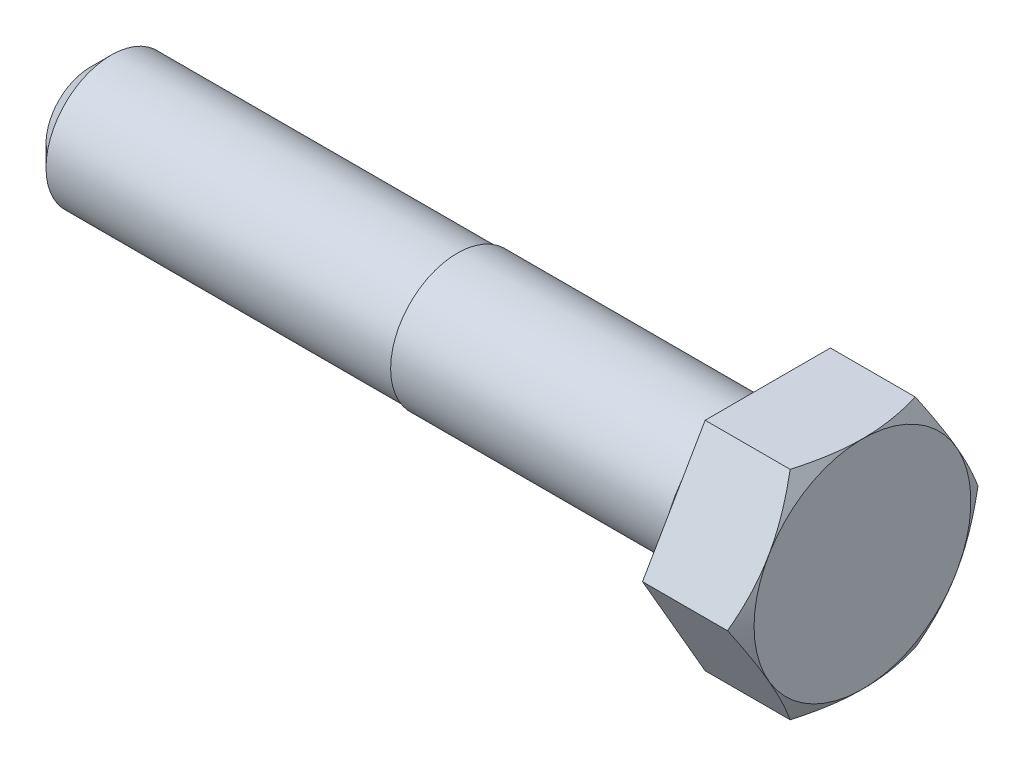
ISO-10303-21;
HEADER;
FILE_DESCRIPTION(('STEP AP214'),'2;1');
FILE_NAME('part.step','',(''),(''),'','','');
FILE_SCHEMA(('AUTOMOTIVE_DESIGN { 1 0 10303 214 1 1 1 1 }'));
ENDSEC;
DATA;
#1=APPLICATION_CONTEXT('core data for automotive mechanical design processes');
#2=APPLICATION_PROTOCOL_DEFINITION('international standard','automotive_design',2000,#1);
#3=PRODUCT_CONTEXT('',#1,'mechanical');
#4=PRODUCT('Part','Part','',(#3));
#5=PRODUCT_RELATED_PRODUCT_CATEGORY('part','',(#4));
#6=PRODUCT_DEFINITION_FORMATION('','',#4);
#7=PRODUCT_DEFINITION_CONTEXT('part definition',#1,'design');
#8=PRODUCT_DEFINITION('design','',#6,#7);
#9=PRODUCT_DEFINITION_SHAPE('','',#8);
#10=(LENGTH_UNIT() NAMED_UNIT(*) SI_UNIT(.MILLI.,.METRE.));
#11=(NAMED_UNIT(*) PLANE_ANGLE_UNIT() SI_UNIT($,.RADIAN.));
#12=(NAMED_UNIT(*) SI_UNIT($,.STERADIAN.) SOLID_ANGLE_UNIT());
#13=UNCERTAINTY_MEASURE_WITH_UNIT(LENGTH_MEASURE(1.E-05),#10,'distance_accuracy_value','');
#14=(GEOMETRIC_REPRESENTATION_CONTEXT(3) GLOBAL_UNCERTAINTY_ASSIGNED_CONTEXT((#13)) GLOBAL_UNIT_ASSIGNED_CONTEXT((#10,
#11,#12)) REPRESENTATION_CONTEXT('',''));
#15=CARTESIAN_POINT('',(0.,0.,0.));
#16=DIRECTION('',(0.,0.,1.));
#17=DIRECTION('',(1.,0.,0.));
#18=AXIS2_PLACEMENT_3D('',#15,#16,#17);
#19=CARTESIAN_POINT('',(6.275,0.,0.));
#20=DIRECTION('',(1.,0.,0.));
#21=DIRECTION('',(0.,0.,-1.));
#22=AXIS2_PLACEMENT_3D('',#19,#20,#21);
#23=PLANE('',#22);
#24=CARTESIAN_POINT('',(6.27500000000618,0.,0.));
#25=DIRECTION('',(-1.,0.,0.));
#26=DIRECTION('',(0.,0.,1.));
#27=AXIS2_PLACEMENT_3D('',#24,#25,#26);
#28=CIRCLE('',#27,6.49675162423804);
#29=CARTESIAN_POINT('',(6.27500000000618,0.,6.49675162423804));
#30=VERTEX_POINT('',#29);
#31=EDGE_CURVE('E85',#30,#30,#28,.T.);
#32=ORIENTED_EDGE('',*,*,#31,.F.);
#33=EDGE_LOOP('',(#32));
#34=FACE_BOUND('',#33,.T.);
#35=ADVANCED_FACE('F16',(#34),#23,.T.);
#36=CARTESIAN_POINT('',(5.68905357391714,0.,0.));
#37=DIRECTION('',(-1.,0.,0.));
#38=DIRECTION('',(0.,0.,1.));
#39=AXIS2_PLACEMENT_3D('',#36,#37,#38);
#40=CONICAL_SURFACE('',#39,7.51164060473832,1.04719755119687);
#41=ORIENTED_EDGE('',*,*,#31,.T.);
#42=EDGE_LOOP('',(#41));
#43=FACE_BOUND('',#42,.T.);
#44=CARTESIAN_POINT('',(5.69256796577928,1.20528046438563E-11,-7.50555349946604));
#45=CARTESIAN_POINT('',(5.7778959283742,-0.255970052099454,-7.35776912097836));
#46=CARTESIAN_POINT('',(5.85630952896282,-0.513867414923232,-7.2088720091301));
#47=CARTESIAN_POINT('',(5.99585171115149,-1.03368204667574,-6.90875689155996));
#48=CARTESIAN_POINT('',(6.05694401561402,-1.29560655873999,-6.75753470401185));
#49=CARTESIAN_POINT('',(6.15687215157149,-1.81667951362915,-6.45669309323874));
#50=CARTESIAN_POINT('',(6.1961752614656,-2.07575899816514,-6.30711348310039));
#51=CARTESIAN_POINT('',(6.25170948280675,-2.59557331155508,-6.00699854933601));
#52=CARTESIAN_POINT('',(6.26796354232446,-2.85630623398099,-5.85646432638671));
#53=CARTESIAN_POINT('',(6.27430814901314,-3.25837855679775,-5.62432776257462));
#54=CARTESIAN_POINT('',(6.27297742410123,-3.39965097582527,-5.54276409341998));
#55=CARTESIAN_POINT('',(6.26326074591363,-3.68202291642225,-5.37973657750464));
#56=CARTESIAN_POINT('',(6.25487464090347,-3.82312243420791,-5.29827273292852));
#57=CARTESIAN_POINT('',(6.23122631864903,-4.10503825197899,-5.13550855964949));
#58=CARTESIAN_POINT('',(6.21595662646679,-4.24585407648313,-5.05420850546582));
#59=CARTESIAN_POINT('',(6.17889071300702,-4.52684665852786,-4.89197736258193));
#60=CARTESIAN_POINT('',(6.15709394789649,-4.66702336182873,-4.81104630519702));
#61=CARTESIAN_POINT('',(6.08135698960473,-5.09317727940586,-4.56500622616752));
#62=CARTESIAN_POINT('',(6.01768275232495,-5.37785705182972,-4.40064628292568));
#63=CARTESIAN_POINT('',(5.86954600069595,-5.94247463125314,-4.07466417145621));
#64=CARTESIAN_POINT('',(5.78513220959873,-6.2224219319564,-3.91303652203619));
#65=CARTESIAN_POINT('',(5.69256796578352,-6.50000000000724,-3.75277674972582));
#66=B_SPLINE_CURVE_WITH_KNOTS('',3,(#44,#45,#46,#47,#48,#49,#50,#51,#52,#53,#54,#55,#56,#57,#58,
#59,#60,#61,#62,#63,#64,#65),.UNSPECIFIED.,.F.,.F.,(4,2,2,2,2,2,2,2,2,2,4),(0.,
0.923168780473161,1.84825696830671,2.75265222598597,3.65614641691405,4.14541079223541,
4.63468569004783,5.12449317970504,5.61434149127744,6.61801291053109,7.61934858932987),.UNSPECIFIED.);
#67=CARTESIAN_POINT('',(5.69256796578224,5.21451335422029E-12,-7.50555349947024));
#68=VERTEX_POINT('',#67);
#69=CARTESIAN_POINT('',(5.69256796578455,-6.5,-3.75277674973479));
#70=VERTEX_POINT('',#69);
#71=EDGE_CURVE('E126',#68,#70,#66,.T.);
#72=ORIENTED_EDGE('',*,*,#71,.F.);
#73=CARTESIAN_POINT('',(5.69256796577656,6.5000000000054,-3.75277674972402));
#74=CARTESIAN_POINT('',(5.74018403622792,6.3571242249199,-3.83526611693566));
#75=CARTESIAN_POINT('',(5.78563893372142,6.2137157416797,-3.91806304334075));
#76=CARTESIAN_POINT('',(5.87163117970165,5.92573416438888,-4.08432928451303));
#77=CARTESIAN_POINT('',(5.91216640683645,5.78116059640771,-4.16779887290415));
#78=CARTESIAN_POINT('',(6.02559686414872,5.34512525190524,-4.4195439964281));
#79=CARTESIAN_POINT('',(6.09011380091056,5.05194235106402,-4.58881322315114));
#80=CARTESIAN_POINT('',(6.16576570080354,4.61319950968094,-4.84212152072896));
#81=CARTESIAN_POINT('',(6.1873163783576,4.46895035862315,-4.92540380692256));
#82=CARTESIAN_POINT('',(6.22345285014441,4.17980036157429,-5.09234463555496));
#83=CARTESIAN_POINT('',(6.23803925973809,4.0348995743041,-5.17600314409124));
#84=CARTESIAN_POINT('',(6.25987545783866,3.74484642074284,-5.34346541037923));
#85=CARTESIAN_POINT('',(6.26713357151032,3.59969452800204,-5.42726889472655));
#86=CARTESIAN_POINT('',(6.27416533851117,3.30926477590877,-5.59494859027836));
#87=CARTESIAN_POINT('',(6.27393922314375,3.16398692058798,-5.67882479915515));
#88=CARTESIAN_POINT('',(6.26303299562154,2.76599791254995,-5.90860386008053));
#89=CARTESIAN_POINT('',(6.24473352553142,2.51341711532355,-6.0544314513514));
#90=CARTESIAN_POINT('',(6.18671200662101,2.00993309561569,-6.34511808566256));
#91=CARTESIAN_POINT('',(6.14697013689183,1.75903164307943,-6.48997610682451));
#92=CARTESIAN_POINT('',(6.04762945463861,1.25453482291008,-6.78124748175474));
#93=CARTESIAN_POINT('',(5.98760985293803,1.00100309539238,-6.92762409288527));
#94=CARTESIAN_POINT('',(5.85139051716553,0.497719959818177,-7.21819474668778));
#95=CARTESIAN_POINT('',(5.77522276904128,0.247962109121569,-7.36239250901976));
#96=CARTESIAN_POINT('',(5.69256796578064,-5.23683170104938E-12,-7.50555349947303));
#97=B_SPLINE_CURVE_WITH_KNOTS('',3,(#73,#74,#75,#76,#77,#78,#79,#80,#81,#82,#83,#84,#85,#86,#87,
#88,#89,#90,#91,#92,#93,#94,#95,#96),.UNSPECIFIED.,.F.,.F.,(4,2,2,2,2,2,2,2,2,2,2,4),(0.,
0.515097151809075,1.0304156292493,2.06319349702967,2.56693469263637,3.07063136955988,
3.57375518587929,4.0768634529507,4.95263085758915,5.82920919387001,6.72522583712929,
7.6194839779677),.UNSPECIFIED.);
#98=CARTESIAN_POINT('',(5.69256796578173,6.50000000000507,-3.75277674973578));
#99=VERTEX_POINT('',#98);
#100=EDGE_CURVE('E81',#99,#68,#97,.T.);
#101=ORIENTED_EDGE('',*,*,#100,.F.);
#102=CARTESIAN_POINT('',(5.69256796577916,6.49999999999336,3.75277674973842));
#103=CARTESIAN_POINT('',(5.74018403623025,6.49999999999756,3.5877980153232));
#104=CARTESIAN_POINT('',(5.78563893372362,6.49999999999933,3.42220416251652));
#105=CARTESIAN_POINT('',(5.87163117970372,6.50000000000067,3.0896716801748));
#106=CARTESIAN_POINT('',(5.91216640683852,6.50000000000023,2.92273250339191));
#107=CARTESIAN_POINT('',(6.02559686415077,6.49999999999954,2.41924225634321));
#108=CARTESIAN_POINT('',(6.09011380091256,6.49999999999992,2.08070380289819));
#109=CARTESIAN_POINT('',(6.1657657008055,6.50000000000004,1.57408720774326));
#110=CARTESIAN_POINT('',(6.18731637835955,6.50000000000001,1.40752263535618));
#111=CARTESIAN_POINT('',(6.22345285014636,6.49999999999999,1.07364097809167));
#112=CARTESIAN_POINT('',(6.23803925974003,6.5,0.906323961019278));
#113=CARTESIAN_POINT('',(6.25987545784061,6.5,0.571399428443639));
#114=CARTESIAN_POINT('',(6.26713357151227,6.5,0.403792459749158));
#115=CARTESIAN_POINT('',(6.27416533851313,6.5,0.0684330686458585));
#116=CARTESIAN_POINT('',(6.27393922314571,6.5,-0.099319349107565));
#117=CARTESIAN_POINT('',(6.26303299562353,6.5,-0.558877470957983));
#118=CARTESIAN_POINT('',(6.24473352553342,6.5,-0.850532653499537));
#119=CARTESIAN_POINT('',(6.18671200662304,6.5,-1.4319059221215));
#120=CARTESIAN_POINT('',(6.14697013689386,6.5,-1.72162196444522));
#121=CARTESIAN_POINT('',(6.04762945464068,6.5,-2.30416471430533));
#122=CARTESIAN_POINT('',(5.98760985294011,6.5,-2.5969179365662));
#123=CARTESIAN_POINT('',(5.85139051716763,6.5,-3.17805924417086));
#124=CARTESIAN_POINT('',(5.77522276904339,6.5,-3.46645476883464));
#125=CARTESIAN_POINT('',(5.69256796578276,6.5,-3.75277674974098));
#126=B_SPLINE_CURVE_WITH_KNOTS('',3,(#102,#103,#104,#105,#106,#107,#108,#109,#110,#111,#112,
#113,#114,#115,#116,#117,#118,#119,#120,#121,#122,#123,#124,#125),.UNSPECIFIED.,.F.,.F.,(4,2,2,
2,2,2,2,2,2,2,2,4),(0.,0.51509715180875,1.03041562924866,2.0631934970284,2.56693469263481,
3.07063136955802,3.57375518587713,4.07686345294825,4.95263085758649,5.82920919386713,
6.7252258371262,7.6194839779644),.UNSPECIFIED.);
#127=CARTESIAN_POINT('',(5.69256796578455,6.5,3.75277674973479));
#128=VERTEX_POINT('',#127);
#129=EDGE_CURVE('E74',#128,#99,#126,.T.);
#130=ORIENTED_EDGE('',*,*,#129,.F.);
#131=CARTESIAN_POINT('',(5.69256796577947,-1.1674643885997E-11,7.50555349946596));
#132=CARTESIAN_POINT('',(5.77789592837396,0.255970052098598,7.35776912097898));
#133=CARTESIAN_POINT('',(5.85630952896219,0.513867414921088,7.20887200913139));
#134=CARTESIAN_POINT('',(5.99585171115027,1.03368204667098,6.90875689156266));
#135=CARTESIAN_POINT('',(6.05694401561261,1.29560655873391,6.75753470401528));
#136=CARTESIAN_POINT('',(6.15687215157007,1.81667951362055,6.45669309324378));
#137=CARTESIAN_POINT('',(6.19617526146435,2.07575899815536,6.30711348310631));
#138=CARTESIAN_POINT('',(6.25170948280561,2.59557331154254,6.00699854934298));
#139=CARTESIAN_POINT('',(6.26796354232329,2.8563062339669,5.85646432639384));
#140=CARTESIAN_POINT('',(6.27430814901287,3.25837855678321,5.62432776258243));
#141=CARTESIAN_POINT('',(6.2729774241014,3.39965097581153,5.54276409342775));
#142=CARTESIAN_POINT('',(6.26326074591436,3.68202291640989,5.37973657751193));
#143=CARTESIAN_POINT('',(6.2548746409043,3.82312243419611,5.29827273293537));
#144=CARTESIAN_POINT('',(6.23122631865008,4.1050382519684,5.13550855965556));
#145=CARTESIAN_POINT('',(6.21595662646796,4.24585407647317,5.05420850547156));
#146=CARTESIAN_POINT('',(6.17889071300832,4.52684665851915,4.89197736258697));
#147=CARTESIAN_POINT('',(6.15709394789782,4.66702336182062,4.8110463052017));
#148=CARTESIAN_POINT('',(6.08135698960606,5.09317727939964,4.5650062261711));
#149=CARTESIAN_POINT('',(6.01768275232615,5.37785705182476,4.40064628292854));
#150=CARTESIAN_POINT('',(5.8695460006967,5.94247463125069,4.07466417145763));
#151=CARTESIAN_POINT('',(5.78513220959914,6.22242193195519,3.9130365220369));
#152=CARTESIAN_POINT('',(5.69256796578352,6.50000000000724,3.75277674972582));
#153=B_SPLINE_CURVE_WITH_KNOTS('',3,(#131,#132,#133,#134,#135,#136,#137,#138,#139,#140,#141,
#142,#143,#144,#145,#146,#147,#148,#149,#150,#151,#152),.UNSPECIFIED.,.F.,.F.,(4,2,2,2,2,2,2,2,
2,2,4),(0.,0.923168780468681,1.84825696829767,2.75265222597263,3.65614641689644,
4.14541079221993,4.63468569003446,5.12449317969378,5.61434149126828,6.61801291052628,
7.61934858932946),.UNSPECIFIED.);
#154=CARTESIAN_POINT('',(5.6925679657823,-5.04355734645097E-12,7.50555349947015));
#155=VERTEX_POINT('',#154);
#156=EDGE_CURVE('E78',#155,#128,#153,.T.);
#157=ORIENTED_EDGE('',*,*,#156,.F.);
#158=CARTESIAN_POINT('',(5.69256796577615,-6.50000000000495,3.75277674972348));
#159=CARTESIAN_POINT('',(5.74018403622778,-6.35712422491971,3.83526611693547));
#160=CARTESIAN_POINT('',(5.78563893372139,-6.21371574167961,3.91806304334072));
#161=CARTESIAN_POINT('',(5.87163117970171,-5.92573416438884,4.08432928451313));
#162=CARTESIAN_POINT('',(5.91216640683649,-5.78116059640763,4.16779887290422));
#163=CARTESIAN_POINT('',(6.02559686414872,-5.34512525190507,4.41954399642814));
#164=CARTESIAN_POINT('',(6.09011380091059,-5.05194235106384,4.58881322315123));
#165=CARTESIAN_POINT('',(6.16576570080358,-4.61319950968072,4.84212152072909));
#166=CARTESIAN_POINT('',(6.18731637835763,-4.46895035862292,4.92540380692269));
#167=CARTESIAN_POINT('',(6.22345285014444,-4.17980036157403,5.0923446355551));
#168=CARTESIAN_POINT('',(6.23803925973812,-4.03489957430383,5.17600314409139));
#169=CARTESIAN_POINT('',(6.25987545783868,-3.74484642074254,5.34346541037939));
#170=CARTESIAN_POINT('',(6.26713357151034,-3.59969452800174,5.42726889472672));
#171=CARTESIAN_POINT('',(6.27416533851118,-3.30926477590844,5.59494859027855));
#172=CARTESIAN_POINT('',(6.27393922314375,-3.16398692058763,5.67882479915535));
#173=CARTESIAN_POINT('',(6.26303299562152,-2.7659979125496,5.90860386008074));
#174=CARTESIAN_POINT('',(6.24473352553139,-2.5134171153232,6.0544314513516));
#175=CARTESIAN_POINT('',(6.18671200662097,-2.00993309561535,6.34511808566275));
#176=CARTESIAN_POINT('',(6.14697013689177,-1.7590316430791,6.4899761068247));
#177=CARTESIAN_POINT('',(6.04762945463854,-1.25453482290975,6.78124748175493));
#178=CARTESIAN_POINT('',(5.98760985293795,-1.00100309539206,6.92762409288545));
#179=CARTESIAN_POINT('',(5.85139051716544,-0.497719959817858,7.21819474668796));
#180=CARTESIAN_POINT('',(5.77522276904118,-0.247962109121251,7.36239250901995));
#181=CARTESIAN_POINT('',(5.69256796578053,5.55470790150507E-12,7.50555349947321));
#182=B_SPLINE_CURVE_WITH_KNOTS('',3,(#158,#159,#160,#161,#162,#163,#164,#165,#166,#167,#168,
#169,#170,#171,#172,#173,#174,#175,#176,#177,#178,#179,#180,#181),.UNSPECIFIED.,.F.,.F.,(4,2,2,
2,2,2,2,2,2,2,2,4),(0.,0.515097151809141,1.03041562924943,2.0631934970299,2.56693469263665,
3.0706313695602,3.57375518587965,4.07686345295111,4.95263085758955,5.82920919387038,
6.72522583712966,7.61948397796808),.UNSPECIFIED.);
#183=CARTESIAN_POINT('',(5.69256796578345,-6.50000000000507,3.75277674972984));
#184=VERTEX_POINT('',#183);
#185=EDGE_CURVE('E99',#184,#155,#182,.T.);
#186=ORIENTED_EDGE('',*,*,#185,.F.);
#187=CARTESIAN_POINT('',(5.69256796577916,-6.49999999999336,-3.75277674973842));
#188=CARTESIAN_POINT('',(5.74018403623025,-6.49999999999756,-3.5877980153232));
#189=CARTESIAN_POINT('',(5.78563893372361,-6.49999999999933,-3.42220416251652));
#190=CARTESIAN_POINT('',(5.87163117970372,-6.50000000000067,-3.0896716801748));
#191=CARTESIAN_POINT('',(5.91216640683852,-6.50000000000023,-2.92273250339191));
#192=CARTESIAN_POINT('',(6.02559686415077,-6.49999999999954,-2.41924225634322));
#193=CARTESIAN_POINT('',(6.09011380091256,-6.49999999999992,-2.08070380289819));
#194=CARTESIAN_POINT('',(6.1657657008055,-6.50000000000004,-1.57408720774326));
#195=CARTESIAN_POINT('',(6.18731637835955,-6.50000000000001,-1.40752263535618));
#196=CARTESIAN_POINT('',(6.22345285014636,-6.49999999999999,-1.07364097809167));
#197=CARTESIAN_POINT('',(6.23803925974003,-6.5,-0.90632396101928));
#198=CARTESIAN_POINT('',(6.25987545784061,-6.5,-0.57139942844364));
#199=CARTESIAN_POINT('',(6.26713357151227,-6.5,-0.403792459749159));
#200=CARTESIAN_POINT('',(6.27416533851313,-6.5,-0.0684330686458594));
#201=CARTESIAN_POINT('',(6.27393922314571,-6.5,0.0993193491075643));
#202=CARTESIAN_POINT('',(6.26303299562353,-6.5,0.558877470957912));
#203=CARTESIAN_POINT('',(6.24473352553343,-6.5,0.850532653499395));
#204=CARTESIAN_POINT('',(6.18671200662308,-6.5,1.43190592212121));
#205=CARTESIAN_POINT('',(6.14697013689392,-6.5,1.72162196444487));
#206=CARTESIAN_POINT('',(6.04762945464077,-6.5,2.30416471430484));
#207=CARTESIAN_POINT('',(5.98760985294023,-6.5,2.59691793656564));
#208=CARTESIAN_POINT('',(5.85139051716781,-6.5,3.17805924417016));
#209=CARTESIAN_POINT('',(5.7752227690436,-6.5,3.46645476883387));
#210=CARTESIAN_POINT('',(5.69256796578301,-6.5,3.75277674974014));
#211=B_SPLINE_CURVE_WITH_KNOTS('',3,(#187,#188,#189,#190,#191,#192,#193,#194,#195,#196,#197,
#198,#199,#200,#201,#202,#203,#204,#205,#206,#207,#208,#209,#210),.UNSPECIFIED.,.F.,.F.,(4,2,2,
2,2,2,2,2,2,2,2,4),(0.,0.51509715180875,1.03041562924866,2.0631934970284,2.56693469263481,
3.07063136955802,3.57375518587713,4.07686345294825,4.95263085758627,5.82920919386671,
6.72522583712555,7.61948397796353),.UNSPECIFIED.);
#212=EDGE_CURVE('E133',#70,#184,#211,.T.);
#213=ORIENTED_EDGE('',*,*,#212,.F.);
#214=EDGE_LOOP('',(#72,#101,#130,#157,#186,#213));
#215=FACE_BOUND('',#214,.T.);
#216=ADVANCED_FACE('F76',(#43,#215),#40,.T.);
#217=CARTESIAN_POINT('',(0.6,6.5,-3.75277674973));
#218=DIRECTION('',(0.,1.,0.));
#219=DIRECTION('',(0.,0.,1.));
#220=AXIS2_PLACEMENT_3D('',#217,#218,#219);
#221=PLANE('',#220);
#222=DIRECTION('',(1.,0.,0.));
#223=VECTOR('',#222,1.);
#224=CARTESIAN_POINT('',(0.6,6.5,3.75277674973));
#225=LINE('',#224,#223);
#226=CARTESIAN_POINT('',(0.6,6.5,3.75277674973));
#227=VERTEX_POINT('',#226);
#228=EDGE_CURVE('E84',#128,#227,#225,.F.);
#229=ORIENTED_EDGE('',*,*,#228,.F.);
#230=ORIENTED_EDGE('',*,*,#129,.T.);
#231=DIRECTION('',(1.,0.,0.));
#232=VECTOR('',#231,1.);
#233=CARTESIAN_POINT('',(0.6,6.5000000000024,-3.75277674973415));
#234=LINE('',#233,#232);
#235=CARTESIAN_POINT('',(0.6,6.5000000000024,-3.75277674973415));
#236=VERTEX_POINT('',#235);
#237=EDGE_CURVE('E143',#236,#99,#234,.T.);
#238=ORIENTED_EDGE('',*,*,#237,.F.);
#239=DIRECTION('',(0.,0.,-1.));
#240=VECTOR('',#239,1.);
#241=CARTESIAN_POINT('',(0.6,6.5,0.));
#242=LINE('',#241,#240);
#243=EDGE_CURVE('E90',#236,#227,#242,.F.);
#244=ORIENTED_EDGE('',*,*,#243,.T.);
#245=EDGE_LOOP('',(#229,#230,#238,#244));
#246=FACE_BOUND('',#245,.T.);
#247=ADVANCED_FACE('F88',(#246),#221,.T.);
#248=CARTESIAN_POINT('',(0.6,6.5,3.75277674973));
#249=DIRECTION('',(0.,0.50000000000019,0.866025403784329));
#250=DIRECTION('',(0.,-0.866025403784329,0.50000000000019));
#251=AXIS2_PLACEMENT_3D('',#248,#249,#250);
#252=PLANE('',#251);
#253=DIRECTION('',(1.,0.,0.));
#254=VECTOR('',#253,1.);
#255=CARTESIAN_POINT('',(0.6,0.,7.50555349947));
#256=LINE('',#255,#254);
#257=CARTESIAN_POINT('',(0.6,-8.96873440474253E-13,7.50555349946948));
#258=VERTEX_POINT('',#257);
#259=EDGE_CURVE('E96',#155,#258,#256,.F.);
#260=ORIENTED_EDGE('',*,*,#259,.F.);
#261=ORIENTED_EDGE('',*,*,#156,.T.);
#262=ORIENTED_EDGE('',*,*,#228,.T.);
#263=DIRECTION('',(0.,-0.86602540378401,0.500000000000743));
#264=VECTOR('',#263,1.);
#265=CARTESIAN_POINT('',(0.6,6.5,3.75277674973));
#266=LINE('',#265,#264);
#267=EDGE_CURVE('E265',#227,#258,#266,.T.);
#268=ORIENTED_EDGE('',*,*,#267,.T.);
#269=EDGE_LOOP('',(#260,#261,#262,#268));
#270=FACE_BOUND('',#269,.T.);
#271=ADVANCED_FACE('F94',(#270),#252,.T.);
#272=CARTESIAN_POINT('',(0.6,0.,7.50555349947));
#273=DIRECTION('',(0.,-0.50000000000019,0.866025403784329));
#274=DIRECTION('',(0.,-0.866025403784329,-0.50000000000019));
#275=AXIS2_PLACEMENT_3D('',#272,#273,#274);
#276=PLANE('',#275);
#277=DIRECTION('',(1.,0.,0.));
#278=VECTOR('',#277,1.);
#279=CARTESIAN_POINT('',(0.6,-6.5,3.75277674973));
#280=LINE('',#279,#278);
#281=CARTESIAN_POINT('',(0.6,-6.5,3.75277674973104));
#282=VERTEX_POINT('',#281);
#283=EDGE_CURVE('E249',#184,#282,#280,.F.);
#284=ORIENTED_EDGE('',*,*,#283,.F.);
#285=ORIENTED_EDGE('',*,*,#185,.T.);
#286=ORIENTED_EDGE('',*,*,#259,.T.);
#287=DIRECTION('',(0.,-0.86602540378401,-0.500000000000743));
#288=VECTOR('',#287,1.);
#289=CARTESIAN_POINT('',(0.6,0.,7.50555349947));
#290=LINE('',#289,#288);
#291=EDGE_CURVE('E273',#258,#282,#290,.T.);
#292=ORIENTED_EDGE('',*,*,#291,.T.);
#293=EDGE_LOOP('',(#284,#285,#286,#292));
#294=FACE_BOUND('',#293,.T.);
#295=ADVANCED_FACE('F160',(#294),#276,.T.);
#296=CARTESIAN_POINT('',(0.6,-6.5,3.75277674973));
#297=DIRECTION('',(0.,-1.,0.));
#298=DIRECTION('',(0.,0.,-1.));
#299=AXIS2_PLACEMENT_3D('',#296,#297,#298);
#300=PLANE('',#299);
#301=DIRECTION('',(1.,0.,0.));
#302=VECTOR('',#301,1.);
#303=CARTESIAN_POINT('',(0.6,-6.5,-3.75277674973));
#304=LINE('',#303,#302);
#305=CARTESIAN_POINT('',(0.6,-6.5,-3.75277674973));
#306=VERTEX_POINT('',#305);
#307=EDGE_CURVE('E244',#70,#306,#304,.F.);
#308=ORIENTED_EDGE('',*,*,#307,.F.);
#309=ORIENTED_EDGE('',*,*,#212,.T.);
#310=ORIENTED_EDGE('',*,*,#283,.T.);
#311=DIRECTION('',(0.,0.,-1.));
#312=VECTOR('',#311,1.);
#313=CARTESIAN_POINT('',(0.6,-6.5,0.));
#314=LINE('',#313,#312);
#315=EDGE_CURVE('E269',#282,#306,#314,.T.);
#316=ORIENTED_EDGE('',*,*,#315,.T.);
#317=EDGE_LOOP('',(#308,#309,#310,#316));
#318=FACE_BOUND('',#317,.T.);
#319=ADVANCED_FACE('F156',(#318),#300,.T.);
#320=CARTESIAN_POINT('',(0.6,-6.5,-3.75277674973));
#321=DIRECTION('',(0.,-0.50000000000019,-0.866025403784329));
#322=DIRECTION('',(0.,0.866025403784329,-0.50000000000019));
#323=AXIS2_PLACEMENT_3D('',#320,#321,#322);
#324=PLANE('',#323);
#325=DIRECTION('',(1.,0.,0.));
#326=VECTOR('',#325,1.);
#327=CARTESIAN_POINT('',(0.6,0.,-7.50555349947));
#328=LINE('',#327,#326);
#329=CARTESIAN_POINT('',(0.6,9.02181415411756E-13,-7.50555349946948));
#330=VERTEX_POINT('',#329);
#331=EDGE_CURVE('E237',#68,#330,#328,.F.);
#332=ORIENTED_EDGE('',*,*,#331,.F.);
#333=ORIENTED_EDGE('',*,*,#71,.T.);
#334=ORIENTED_EDGE('',*,*,#307,.T.);
#335=DIRECTION('',(0.,0.86602540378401,-0.500000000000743));
#336=VECTOR('',#335,1.);
#337=CARTESIAN_POINT('',(0.6,-6.5,-3.75277674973));
#338=LINE('',#337,#336);
#339=EDGE_CURVE('E261',#306,#330,#338,.T.);
#340=ORIENTED_EDGE('',*,*,#339,.T.);
#341=EDGE_LOOP('',(#332,#333,#334,#340));
#342=FACE_BOUND('',#341,.T.);
#343=ADVANCED_FACE('F151',(#342),#324,.T.);
#344=CARTESIAN_POINT('',(0.6,0.,-7.50555349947));
#345=DIRECTION('',(0.,0.50000000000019,-0.866025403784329));
#346=DIRECTION('',(0.,0.866025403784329,0.50000000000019));
#347=AXIS2_PLACEMENT_3D('',#344,#345,#346);
#348=PLANE('',#347);
#349=ORIENTED_EDGE('',*,*,#237,.T.);
#350=ORIENTED_EDGE('',*,*,#100,.T.);
#351=ORIENTED_EDGE('',*,*,#331,.T.);
#352=DIRECTION('',(0.,0.86602540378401,0.500000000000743));
#353=VECTOR('',#352,1.);
#354=CARTESIAN_POINT('',(0.6,0.,-7.50555349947));
#355=LINE('',#354,#353);
#356=EDGE_CURVE('E258',#330,#236,#355,.T.);
#357=ORIENTED_EDGE('',*,*,#356,.T.);
#358=EDGE_LOOP('',(#349,#350,#351,#357));
#359=FACE_BOUND('',#358,.T.);
#360=ADVANCED_FACE('F146',(#359),#348,.T.);
#361=CARTESIAN_POINT('',(0.6,0.,0.));
#362=DIRECTION('',(1.,0.,0.));
#363=DIRECTION('',(0.,0.,-1.));
#364=AXIS2_PLACEMENT_3D('',#361,#362,#363);
#365=PLANE('',#364);
#366=CARTESIAN_POINT('',(0.6,0.,0.));
#367=DIRECTION('',(1.,0.,0.));
#368=DIRECTION('',(0.,0.,-1.));
#369=AXIS2_PLACEMENT_3D('',#366,#367,#368);
#370=CIRCLE('',#369,5.735);
#371=CARTESIAN_POINT('',(0.6,0.,-5.735));
#372=VERTEX_POINT('',#371);
#373=EDGE_CURVE('E144',#372,#372,#370,.F.);
#374=ORIENTED_EDGE('',*,*,#373,.F.);
#375=EDGE_LOOP('',(#374));
#376=FACE_BOUND('',#375,.T.);
#377=ORIENTED_EDGE('',*,*,#339,.F.);
#378=ORIENTED_EDGE('',*,*,#315,.F.);
#379=ORIENTED_EDGE('',*,*,#291,.F.);
#380=ORIENTED_EDGE('',*,*,#267,.F.);
#381=ORIENTED_EDGE('',*,*,#243,.F.);
#382=ORIENTED_EDGE('',*,*,#356,.F.);
#383=EDGE_LOOP('',(#377,#378,#379,#380,#381,#382));
#384=FACE_BOUND('',#383,.T.);
#385=ADVANCED_FACE('F150',(#376,#384),#365,.F.);
#386=CARTESIAN_POINT('',(0.3,0.,0.));
#387=DIRECTION('',(1.,0.,0.));
#388=DIRECTION('',(0.,0.,-1.));
#389=AXIS2_PLACEMENT_3D('',#386,#387,#388);
#390=CYLINDRICAL_SURFACE('',#389,5.735);
#391=CARTESIAN_POINT('',(0.,0.,0.));
#392=DIRECTION('',(1.,0.,0.));
#393=DIRECTION('',(0.,0.,-1.));
#394=AXIS2_PLACEMENT_3D('',#391,#392,#393);
#395=CIRCLE('',#394,5.735);
#396=CARTESIAN_POINT('',(0.,0.,-5.735));
#397=VERTEX_POINT('',#396);
#398=EDGE_CURVE('E287',#397,#397,#395,.T.);
#399=ORIENTED_EDGE('',*,*,#398,.T.);
#400=EDGE_LOOP('',(#399));
#401=FACE_BOUND('',#400,.T.);
#402=ORIENTED_EDGE('',*,*,#373,.T.);
#403=EDGE_LOOP('',(#402));
#404=FACE_BOUND('',#403,.T.);
#405=ADVANCED_FACE('F294',(#401,#404),#390,.T.);
#406=CARTESIAN_POINT('',(0.,0.,0.));
#407=DIRECTION('',(1.,0.,0.));
#408=DIRECTION('',(0.,0.,-1.));
#409=AXIS2_PLACEMENT_3D('',#406,#407,#408);
#410=PLANE('',#409);
#411=CARTESIAN_POINT('',(0.,-4.4,0.));
#412=CARTESIAN_POINT('',(0.,-4.40000152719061,0.0719949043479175));
#413=CARTESIAN_POINT('',(0.,-4.39823303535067,0.14398967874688));
#414=CARTESIAN_POINT('',(0.,-4.39116697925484,0.287805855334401));
#415=CARTESIAN_POINT('',(0.,-4.38586941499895,0.35962725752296));
#416=CARTESIAN_POINT('',(0.,-4.37175617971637,0.502923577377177));
#417=CARTESIAN_POINT('',(0.,-4.36294050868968,0.574398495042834));
#418=CARTESIAN_POINT('',(0.,-4.34181277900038,0.716829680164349));
#419=CARTESIAN_POINT('',(0.,-4.32950072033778,0.787785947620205));
#420=CARTESIAN_POINT('',(0.,-4.30140974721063,0.929008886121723));
#421=CARTESIAN_POINT('',(0.,-4.2856308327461,0.999275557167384));
#422=CARTESIAN_POINT('',(0.,-4.25064419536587,1.13895002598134));
#423=CARTESIAN_POINT('',(0.,-4.23143647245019,1.20835782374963));
#424=CARTESIAN_POINT('',(0.,-4.18963848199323,1.34614733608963));
#425=CARTESIAN_POINT('',(0.,-4.16704821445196,1.41452905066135));
#426=CARTESIAN_POINT('',(0.,-4.11853955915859,1.55010165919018));
#427=CARTESIAN_POINT('',(0.,-4.09262117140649,1.6172925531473));
#428=CARTESIAN_POINT('',(0.,-4.0375187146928,1.75032165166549));
#429=CARTESIAN_POINT('',(0.,-4.00833464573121,1.81615985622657));
#430=CARTESIAN_POINT('',(0.,-3.94677113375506,1.94632496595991));
#431=CARTESIAN_POINT('',(0.,-3.9143916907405,2.01065187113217));
#432=CARTESIAN_POINT('',(0.,-3.84651543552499,2.1376394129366));
#433=CARTESIAN_POINT('',(0.,-3.81101862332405,2.20030004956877));
#434=CARTESIAN_POINT('',(0.,-3.73699314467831,2.32380409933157));
#435=CARTESIAN_POINT('',(0.,-3.69846447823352,2.3846475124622));
#436=CARTESIAN_POINT('',(0.,-3.61846811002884,2.50437053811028));
#437=CARTESIAN_POINT('',(0.,-3.57700040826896,2.56325015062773));
#438=CARTESIAN_POINT('',(0.,-3.49122586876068,2.67890372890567));
#439=CARTESIAN_POINT('',(0.,-3.4469190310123,2.73567769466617));
#440=CARTESIAN_POINT('',(0.,-3.35557295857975,2.84698320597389));
#441=CARTESIAN_POINT('',(0.,-3.30853372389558,2.90151475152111));
#442=CARTESIAN_POINT('',(0.,-3.21183617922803,3.00820405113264));
#443=CARTESIAN_POINT('',(0.,-3.16217786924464,3.06036180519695));
#444=CARTESIAN_POINT('',(0.,-3.06036180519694,3.16217786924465));
#445=CARTESIAN_POINT('',(0.,-3.00820405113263,3.21183617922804));
#446=CARTESIAN_POINT('',(0.,-2.9015147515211,3.30853372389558));
#447=CARTESIAN_POINT('',(0.,-2.84698320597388,3.35557295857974));
#448=CARTESIAN_POINT('',(0.,-2.73567769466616,3.44691903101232));
#449=CARTESIAN_POINT('',(0.,-2.67890372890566,3.49122586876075));
#450=CARTESIAN_POINT('',(0.,-2.56325015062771,3.57700040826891));
#451=CARTESIAN_POINT('',(0.,-2.50437053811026,3.61846811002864));
#452=CARTESIAN_POINT('',(0.,-2.3846475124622,3.69846447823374));
#453=CARTESIAN_POINT('',(0.,-2.3238040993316,3.7369931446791));
#454=CARTESIAN_POINT('',(0.,-2.20030004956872,3.81101862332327));
#455=CARTESIAN_POINT('',(0.,-2.13763941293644,3.84651543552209));
#456=CARTESIAN_POINT('',(0.,-2.0106518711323,3.91439169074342));
#457=CARTESIAN_POINT('',(0.,-1.94632496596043,3.94677113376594));
#458=CARTESIAN_POINT('',(0.,-1.81615985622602,4.00833464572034));
#459=CARTESIAN_POINT('',(0.,-1.75032165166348,4.03751871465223));
#460=CARTESIAN_POINT('',(0.,-1.61729255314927,4.09262117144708));
#461=CARTESIAN_POINT('',(0.,-1.55010165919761,4.11853955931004));
#462=CARTESIAN_POINT('',(0.,-1.41452905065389,4.16704821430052));
#463=CARTESIAN_POINT('',(0.,-1.34614733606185,4.18963848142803));
#464=CARTESIAN_POINT('',(0.,-1.20835782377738,4.2314364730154));
#465=CARTESIAN_POINT('',(0.,-1.13895002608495,4.25064419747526));
#466=CARTESIAN_POINT('',(0.,-0.999275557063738,4.28563083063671));
#467=CARTESIAN_POINT('',(0.,-0.929008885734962,4.30140973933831));
#468=CARTESIAN_POINT('',(0.,-0.787785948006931,4.3295007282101));
#469=CARTESIAN_POINT('',(0.,-0.716829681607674,4.3418128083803));
#470=CARTESIAN_POINT('',(0.,-0.574398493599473,4.36294047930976));
#471=CARTESIAN_POINT('',(0.,-0.502923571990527,4.37175607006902));
#472=CARTESIAN_POINT('',(0.,-0.359627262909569,4.3858695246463));
#473=CARTESIAN_POINT('',(0.,-0.287805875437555,4.39116738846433));
#474=CARTESIAN_POINT('',(0.,-0.143989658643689,4.39823262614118));
#475=CARTESIAN_POINT('',(0.,-0.0719948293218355,4.4));
#476=CARTESIAN_POINT('',(0.,0.0719948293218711,4.4));
#477=CARTESIAN_POINT('',(0.,0.143989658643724,4.39823262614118));
#478=CARTESIAN_POINT('',(0.,0.287805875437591,4.39116738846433));
#479=CARTESIAN_POINT('',(0.,0.359627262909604,4.38586952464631));
#480=CARTESIAN_POINT('',(0.,0.502923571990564,4.37175607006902));
#481=CARTESIAN_POINT('',(0.,0.574398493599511,4.36294047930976));
#482=CARTESIAN_POINT('',(0.,0.716829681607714,4.34181280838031));
#483=CARTESIAN_POINT('',(0.,0.787785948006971,4.32950072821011));
#484=CARTESIAN_POINT('',(0.,0.929008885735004,4.30140973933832));
#485=CARTESIAN_POINT('',(0.,0.999275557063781,4.28563083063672));
#486=CARTESIAN_POINT('',(0.,1.13895002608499,4.25064419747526));
#487=CARTESIAN_POINT('',(0.,1.20835782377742,4.2314364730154));
#488=CARTESIAN_POINT('',(0.,1.3461473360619,4.18963848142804));
#489=CARTESIAN_POINT('',(0.,1.41452905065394,4.16704821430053));
#490=CARTESIAN_POINT('',(0.,1.55010165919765,4.11853955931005));
#491=CARTESIAN_POINT('',(0.,1.61729255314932,4.09262117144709));
#492=CARTESIAN_POINT('',(0.,1.75032165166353,4.03751871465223));
#493=CARTESIAN_POINT('',(0.,1.81615985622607,4.00833464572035));
#494=CARTESIAN_POINT('',(0.,1.94632496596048,3.94677113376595));
#495=CARTESIAN_POINT('',(0.,2.01065187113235,3.91439169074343));
#496=CARTESIAN_POINT('',(0.,2.13763941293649,3.84651543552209));
#497=CARTESIAN_POINT('',(0.,2.20030004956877,3.81101862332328));
#498=CARTESIAN_POINT('',(0.,2.32380409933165,3.73699314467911));
#499=CARTESIAN_POINT('',(0.,2.38464751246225,3.69846447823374));
#500=CARTESIAN_POINT('',(0.,2.50437053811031,3.61846811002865));
#501=CARTESIAN_POINT('',(0.,2.56325015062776,3.57700040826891));
#502=CARTESIAN_POINT('',(0.,2.67890372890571,3.49122586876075));
#503=CARTESIAN_POINT('',(0.,2.73567769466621,3.44691903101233));
#504=CARTESIAN_POINT('',(0.,2.84698320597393,3.35557295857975));
#505=CARTESIAN_POINT('',(0.,2.90151475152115,3.30853372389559));
#506=CARTESIAN_POINT('',(0.,3.00820405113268,3.21183617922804));
#507=CARTESIAN_POINT('',(0.,3.06036180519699,3.16217786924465));
#508=CARTESIAN_POINT('',(0.,3.16217786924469,3.06036180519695));
#509=CARTESIAN_POINT('',(0.,3.21183617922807,3.00820405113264));
#510=CARTESIAN_POINT('',(0.,3.30853372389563,2.90151475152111));
#511=CARTESIAN_POINT('',(0.,3.3555729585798,2.84698320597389));
#512=CARTESIAN_POINT('',(0.,3.44691903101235,2.73567769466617));
#513=CARTESIAN_POINT('',(0.,3.49122586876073,2.67890372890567));
#514=CARTESIAN_POINT('',(0.,3.577000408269,2.56325015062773));
#515=CARTESIAN_POINT('',(0.,3.61846811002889,2.50437053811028));
#516=CARTESIAN_POINT('',(0.,3.69846447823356,2.3846475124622));
#517=CARTESIAN_POINT('',(0.,3.73699314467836,2.32380409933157));
#518=CARTESIAN_POINT('',(0.,3.81101862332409,2.20030004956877));
#519=CARTESIAN_POINT('',(0.,3.84651543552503,2.1376394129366));
#520=CARTESIAN_POINT('',(0.,3.91439169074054,2.01065187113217));
#521=CARTESIAN_POINT('',(0.,3.9467711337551,1.9463249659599));
#522=CARTESIAN_POINT('',(0.,4.00833464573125,1.81615985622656));
#523=CARTESIAN_POINT('',(0.,4.03751871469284,1.75032165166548));
#524=CARTESIAN_POINT('',(0.,4.09262117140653,1.61729255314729));
#525=CARTESIAN_POINT('',(0.,4.11853955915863,1.55010165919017));
#526=CARTESIAN_POINT('',(0.,4.16704821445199,1.41452905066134));
#527=CARTESIAN_POINT('',(0.,4.18963848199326,1.34614733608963));
#528=CARTESIAN_POINT('',(0.,4.23143647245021,1.20835782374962));
#529=CARTESIAN_POINT('',(0.,4.2506441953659,1.13895002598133));
#530=CARTESIAN_POINT('',(0.,4.28563083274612,0.999275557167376));
#531=CARTESIAN_POINT('',(0.,4.30140974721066,0.929008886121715));
#532=CARTESIAN_POINT('',(0.,4.3295007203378,0.787785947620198));
#533=CARTESIAN_POINT('',(0.,4.3418127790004,0.716829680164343));
#534=CARTESIAN_POINT('',(0.,4.36294050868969,0.574398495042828));
#535=CARTESIAN_POINT('',(0.,4.37175617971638,0.50292357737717));
#536=CARTESIAN_POINT('',(0.,4.38586941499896,0.359627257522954));
#537=CARTESIAN_POINT('',(0.,4.39116697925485,0.287805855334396));
#538=CARTESIAN_POINT('',(0.,4.39823303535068,0.143989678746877));
#539=CARTESIAN_POINT('',(0.,4.40000152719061,0.071994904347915));
#540=CARTESIAN_POINT('',(0.,4.4,0.));
#541=B_SPLINE_CURVE_WITH_KNOTS('',3,(#411,#412,#413,#414,#415,#416,#417,#418,#419,#420,#421,
#422,#423,#424,#425,#426,#427,#428,#429,#430,#431,#432,#433,#434,#435,#436,#437,#438,#439,#440,
#441,#442,#443,#444,#445,#446,#447,#448,#449,#450,#451,#452,#453,#454,#455,#456,#457,#458,#459,
#460,#461,#462,#463,#464,#465,#466,#467,#468,#469,#470,#471,#472,#473,#474,#475,#476,#477,#478,
#479,#480,#481,#482,#483,#484,#485,#486,#487,#488,#489,#490,#491,#492,#493,#494,#495,#496,#497,
#498,#499,#500,#501,#502,#503,#504,#505,#506,#507,#508,#509,#510,#511,#512,#513,#514,#515,#516,
#517,#518,#519,#520,#521,#522,#523,#524,#525,#526,#527,#528,#529,#530,#531,#532,#533,#534,#535,
#536,#537,#538,#539,#540),.UNSPECIFIED.,.F.,.F.,(4,2,2,2,2,2,2,2,2,2,2,2,2,2,2,2,2,2,2,2,2,2,2,
2,2,2,2,2,2,2,2,2,2,2,2,2,2,2,2,2,2,2,2,2,2,2,2,2,2,2,2,2,2,2,2,2,2,2,2,2,2,2,2,2,4),(0.,
0.215962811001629,0.431925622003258,0.647888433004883,0.863851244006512,1.07981405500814,
1.29577686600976,1.5117396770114,1.72770248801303,1.94366529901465,2.15962811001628,
2.3755909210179,2.59155373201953,2.80751654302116,3.02347935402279,3.23944216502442,
3.45540497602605,3.67136778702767,3.8873305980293,4.10329340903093,4.31925622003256,
4.53521903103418,4.75118184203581,4.96714465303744,5.18310746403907,5.3990702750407,
5.61503308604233,5.83099589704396,6.04695870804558,6.26292151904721,6.47888433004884,
6.69484714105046,6.91080995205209,7.12677276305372,7.34273557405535,7.55869838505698,
7.77466119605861,7.99062400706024,8.20658681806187,8.4225496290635,8.63851244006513,
8.85447525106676,9.07043806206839,9.28640087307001,9.50236368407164,9.71832649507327,
9.9342893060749,10.1502521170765,10.3662149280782,10.5821777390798,10.7981405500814,
11.014103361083,11.2300661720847,11.4460289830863,11.6619917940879,11.8779546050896,
12.0939174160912,12.3098802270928,12.5258430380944,12.7418058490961,12.9577686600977,
13.1737314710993,13.3896942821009,13.6056570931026,13.8216199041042),.UNSPECIFIED.);
#542=CARTESIAN_POINT('',(0.,4.40000000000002,0.));
#543=VERTEX_POINT('',#542);
#544=CARTESIAN_POINT('',(0.,-4.39999999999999,0.));
#545=VERTEX_POINT('',#544);
#546=EDGE_CURVE('E211',#543,#545,#541,.F.);
#547=ORIENTED_EDGE('',*,*,#546,.T.);
#548=CARTESIAN_POINT('',(0.,0.,0.));
#549=DIRECTION('',(-1.,0.,0.));
#550=DIRECTION('',(0.,1.,0.));
#551=AXIS2_PLACEMENT_3D('',#548,#549,#550);
#552=CIRCLE('',#551,4.40000000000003);
#553=EDGE_CURVE('E35',#545,#543,#552,.F.);
#554=ORIENTED_EDGE('',*,*,#553,.T.);
#555=EDGE_LOOP('',(#547,#554));
#556=FACE_BOUND('',#555,.T.);
#557=ORIENTED_EDGE('',*,*,#398,.F.);
#558=EDGE_LOOP('',(#557));
#559=FACE_BOUND('',#558,.T.);
#560=ADVANCED_FACE('F199',(#556,#559),#410,.F.);
#561=CARTESIAN_POINT('',(-0.4,0.,0.));
#562=DIRECTION('',(1.,0.,0.));
#563=DIRECTION('',(0.,-1.,0.));
#564=AXIS2_PLACEMENT_3D('',#561,#562,#563);
#565=TOROIDAL_SURFACE('',#564,4.4,0.4);
#566=ORIENTED_EDGE('',*,*,#553,.F.);
#567=ORIENTED_EDGE('',*,*,#546,.F.);
#568=EDGE_LOOP('',(#566,#567));
#569=FACE_BOUND('',#568,.T.);
#570=CARTESIAN_POINT('',(-0.399999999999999,0.,0.));
#571=DIRECTION('',(-1.,0.,0.));
#572=DIRECTION('',(0.,0.,1.));
#573=AXIS2_PLACEMENT_3D('',#570,#571,#572);
#574=CIRCLE('',#573,4.);
#575=CARTESIAN_POINT('',(-0.399999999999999,0.,4.));
#576=VERTEX_POINT('',#575);
#577=EDGE_CURVE('E206',#576,#576,#574,.T.);
#578=ORIENTED_EDGE('',*,*,#577,.F.);
#579=EDGE_LOOP('',(#578));
#580=FACE_BOUND('',#579,.T.);
#581=ADVANCED_FACE('F193',(#569,#580),#565,.F.);
#582=CARTESIAN_POINT('',(-9.,0.,0.));
#583=DIRECTION('',(-1.,0.,0.));
#584=DIRECTION('',(0.,0.,1.));
#585=AXIS2_PLACEMENT_3D('',#582,#583,#584);
#586=CYLINDRICAL_SURFACE('',#585,4.);
#587=CARTESIAN_POINT('',(-18.,0.,0.));
#588=DIRECTION('',(-1.,0.,0.));
#589=DIRECTION('',(0.,0.,1.));
#590=AXIS2_PLACEMENT_3D('',#587,#588,#589);
#591=CIRCLE('',#590,4.);
#592=CARTESIAN_POINT('',(-18.,0.,4.));
#593=VERTEX_POINT('',#592);
#594=EDGE_CURVE('E209',#593,#593,#591,.T.);
#595=ORIENTED_EDGE('',*,*,#594,.F.);
#596=EDGE_LOOP('',(#595));
#597=FACE_BOUND('',#596,.T.);
#598=ORIENTED_EDGE('',*,*,#577,.T.);
#599=EDGE_LOOP('',(#598));
#600=FACE_BOUND('',#599,.T.);
#601=ADVANCED_FACE('F190',(#597,#600),#586,.T.);
#602=CARTESIAN_POINT('',(-40.,0.,0.));
#603=DIRECTION('',(-1.,0.,0.));
#604=DIRECTION('',(0.,0.,1.));
#605=AXIS2_PLACEMENT_3D('',#602,#603,#604);
#606=PLANE('',#605);
#607=CARTESIAN_POINT('',(-40.0000000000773,0.,1.41359146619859E-13));
#608=DIRECTION('',(1.,0.,-1.13797860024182E-13));
#609=DIRECTION('',(-1.13797860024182E-13,0.,-1.));
#610=AXIS2_PLACEMENT_3D('',#607,#608,#609);
#611=CIRCLE('',#610,2.65243902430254);
#612=CARTESIAN_POINT('',(-40.0000000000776,0.,-2.65243902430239));
#613=VERTEX_POINT('',#612);
#614=EDGE_CURVE('E283',#613,#613,#611,.T.);
#615=ORIENTED_EDGE('',*,*,#614,.F.);
#616=EDGE_LOOP('',(#615));
#617=FACE_BOUND('',#616,.T.);
#618=ADVANCED_FACE('F186',(#617),#606,.T.);
#619=CARTESIAN_POINT('',(-18.,0.,0.));
#620=DIRECTION('',(-1.,0.,0.));
#621=DIRECTION('',(0.,0.,1.));
#622=AXIS2_PLACEMENT_3D('',#619,#620,#621);
#623=PLANE('',#622);
#624=CARTESIAN_POINT('',(-18.,0.,0.));
#625=DIRECTION('',(-1.,0.,0.));
#626=DIRECTION('',(0.,0.,1.));
#627=AXIS2_PLACEMENT_3D('',#624,#625,#626);
#628=CIRCLE('',#627,3.90243902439);
#629=CARTESIAN_POINT('',(-18.,0.,3.90243902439));
#630=VERTEX_POINT('',#629);
#631=EDGE_CURVE('E27',#630,#630,#628,.T.);
#632=ORIENTED_EDGE('',*,*,#631,.F.);
#633=EDGE_LOOP('',(#632));
#634=FACE_BOUND('',#633,.T.);
#635=ORIENTED_EDGE('',*,*,#594,.T.);
#636=EDGE_LOOP('',(#635));
#637=FACE_BOUND('',#636,.T.);
#638=ADVANCED_FACE('F178',(#634,#637),#623,.T.);
#639=CARTESIAN_POINT('',(-38.7499999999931,0.,0.));
#640=DIRECTION('',(1.,0.,-1.13797860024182E-13));
#641=DIRECTION('',(-1.13797860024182E-13,0.,-1.));
#642=AXIS2_PLACEMENT_3D('',#639,#640,#641);
#643=CONICAL_SURFACE('',#642,3.90243902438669,0.785398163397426);
#644=CARTESIAN_POINT('',(-38.75,0.,0.));
#645=DIRECTION('',(-1.,0.,0.));
#646=DIRECTION('',(0.,0.,1.));
#647=AXIS2_PLACEMENT_3D('',#644,#645,#646);
#648=CIRCLE('',#647,3.90243902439);
#649=CARTESIAN_POINT('',(-38.75,0.,3.90243902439));
#650=VERTEX_POINT('',#649);
#651=EDGE_CURVE('E11',#650,#650,#648,.F.);
#652=ORIENTED_EDGE('',*,*,#651,.F.);
#653=EDGE_LOOP('',(#652));
#654=FACE_BOUND('',#653,.T.);
#655=ORIENTED_EDGE('',*,*,#614,.T.);
#656=EDGE_LOOP('',(#655));
#657=FACE_BOUND('',#656,.T.);
#658=ADVANCED_FACE('F172',(#654,#657),#643,.T.);
#659=CARTESIAN_POINT('',(-29.,0.,0.));
#660=DIRECTION('',(-1.,0.,0.));
#661=DIRECTION('',(0.,0.,1.));
#662=AXIS2_PLACEMENT_3D('',#659,#660,#661);
#663=CYLINDRICAL_SURFACE('',#662,3.90243902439);
#664=ORIENTED_EDGE('',*,*,#631,.T.);
#665=EDGE_LOOP('',(#664));
#666=FACE_BOUND('',#665,.T.);
#667=ORIENTED_EDGE('',*,*,#651,.T.);
#668=EDGE_LOOP('',(#667));
#669=FACE_BOUND('',#668,.T.);
#670=ADVANCED_FACE('F170',(#666,#669),#663,.T.);
#671=CLOSED_SHELL('',(#35,#216,#247,#271,#295,#319,#343,#360,#385,#405,#560,#581,#601,#618,#638,
#658,#670));
#672=MANIFOLD_SOLID_BREP('B1',#671);
#673=ADVANCED_BREP_SHAPE_REPRESENTATION('',(#18,#672),#14);
#674=SHAPE_DEFINITION_REPRESENTATION(#9,#673);
ENDSEC;
END-ISO-10303-21;
